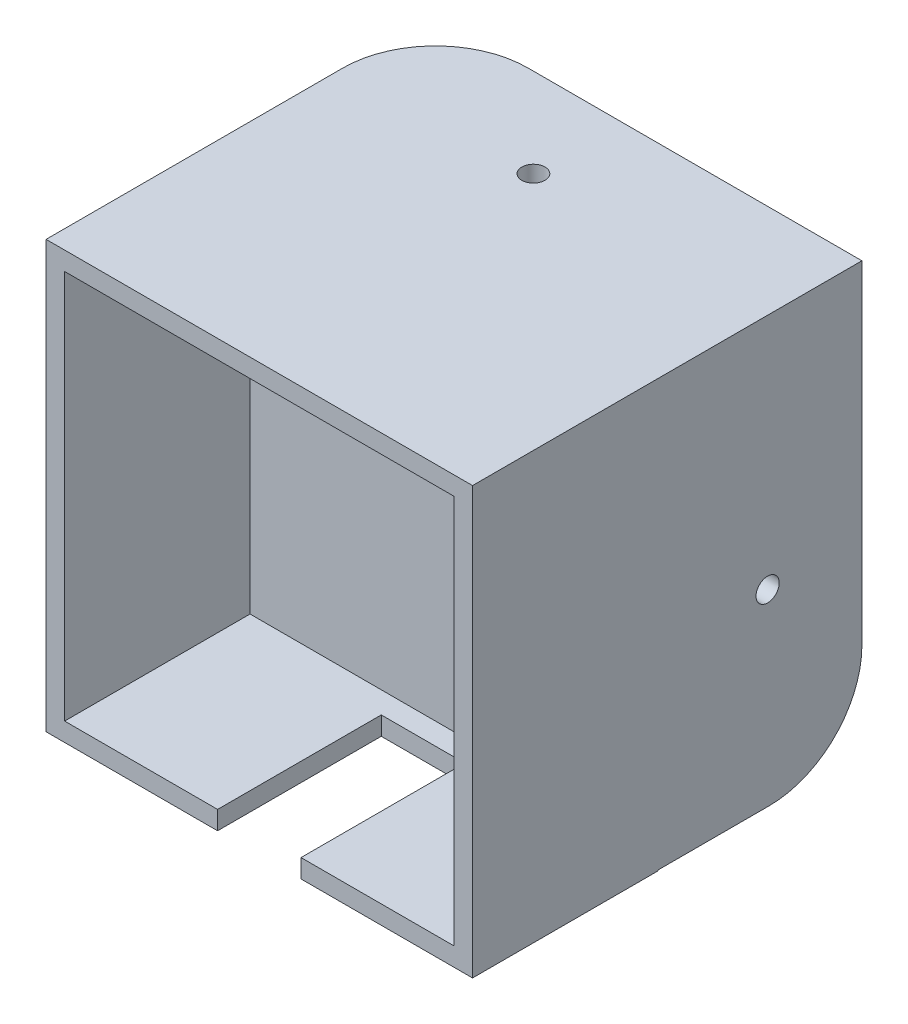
ISO-10303-21;
HEADER;
FILE_DESCRIPTION(('STEP AP214'),'2;1');
FILE_NAME('part.step','',(''),(''),'','','');
FILE_SCHEMA(('AUTOMOTIVE_DESIGN { 1 0 10303 214 1 1 1 1 }'));
ENDSEC;
DATA;
#1=APPLICATION_CONTEXT('core data for automotive mechanical design processes');
#2=APPLICATION_PROTOCOL_DEFINITION('international standard','automotive_design',2000,#1);
#3=PRODUCT_CONTEXT('',#1,'mechanical');
#4=PRODUCT('Part','Part','',(#3));
#5=PRODUCT_RELATED_PRODUCT_CATEGORY('part','',(#4));
#6=PRODUCT_DEFINITION_FORMATION('','',#4);
#7=PRODUCT_DEFINITION_CONTEXT('part definition',#1,'design');
#8=PRODUCT_DEFINITION('design','',#6,#7);
#9=PRODUCT_DEFINITION_SHAPE('','',#8);
#10=(LENGTH_UNIT() NAMED_UNIT(*) SI_UNIT(.MILLI.,.METRE.));
#11=(NAMED_UNIT(*) PLANE_ANGLE_UNIT() SI_UNIT($,.RADIAN.));
#12=(NAMED_UNIT(*) SI_UNIT($,.STERADIAN.) SOLID_ANGLE_UNIT());
#13=UNCERTAINTY_MEASURE_WITH_UNIT(LENGTH_MEASURE(1.E-05),#10,'distance_accuracy_value','');
#14=(GEOMETRIC_REPRESENTATION_CONTEXT(3) GLOBAL_UNCERTAINTY_ASSIGNED_CONTEXT((#13)) GLOBAL_UNIT_ASSIGNED_CONTEXT((#10,
#11,#12)) REPRESENTATION_CONTEXT('',''));
#15=CARTESIAN_POINT('',(0.,0.,0.));
#16=DIRECTION('',(0.,0.,1.));
#17=DIRECTION('',(1.,0.,0.));
#18=AXIS2_PLACEMENT_3D('',#15,#16,#17);
#19=CARTESIAN_POINT('',(0.,0.,-2.));
#20=DIRECTION('',(0.,0.,-1.));
#21=DIRECTION('',(-1.,0.,0.));
#22=AXIS2_PLACEMENT_3D('',#19,#20,#21);
#23=PLANE('',#22);
#24=DIRECTION('',(1.,0.,0.));
#25=VECTOR('',#24,1.);
#26=CARTESIAN_POINT('',(23.,18.,-2.));
#27=LINE('',#26,#25);
#28=CARTESIAN_POINT('',(-23.,18.,-2.));
#29=VERTEX_POINT('',#28);
#30=CARTESIAN_POINT('',(18.,18.,-2.));
#31=VERTEX_POINT('',#30);
#32=EDGE_CURVE('E175',#29,#31,#27,.T.);
#33=ORIENTED_EDGE('',*,*,#32,.T.);
#34=DIRECTION('',(0.,-1.,0.));
#35=VECTOR('',#34,1.);
#36=CARTESIAN_POINT('',(18.,-22.9159249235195,-2.));
#37=LINE('',#36,#35);
#38=CARTESIAN_POINT('',(18.,-22.9159249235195,-2.));
#39=VERTEX_POINT('',#38);
#40=EDGE_CURVE('E295',#31,#39,#37,.T.);
#41=ORIENTED_EDGE('',*,*,#40,.T.);
#42=DIRECTION('',(-1.,0.,0.));
#43=VECTOR('',#42,1.);
#44=CARTESIAN_POINT('',(23.,-22.9159249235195,-2.));
#45=LINE('',#44,#43);
#46=CARTESIAN_POINT('',(-23.,-22.9159249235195,-2.));
#47=VERTEX_POINT('',#46);
#48=EDGE_CURVE('E188',#39,#47,#45,.T.);
#49=ORIENTED_EDGE('',*,*,#48,.T.);
#50=DIRECTION('',(0.,1.,0.));
#51=VECTOR('',#50,1.);
#52=CARTESIAN_POINT('',(-23.,23.,-2.));
#53=LINE('',#52,#51);
#54=EDGE_CURVE('E170',#47,#29,#53,.T.);
#55=ORIENTED_EDGE('',*,*,#54,.T.);
#56=EDGE_LOOP('',(#33,#41,#49,#55));
#57=FACE_BOUND('',#56,.T.);
#58=ADVANCED_FACE('F33',(#57),#23,.T.);
#59=CARTESIAN_POINT('',(0.,0.,20.));
#60=DIRECTION('',(0.,0.,-1.));
#61=DIRECTION('',(-1.,0.,0.));
#62=AXIS2_PLACEMENT_3D('',#59,#60,#61);
#63=PLANE('',#62);
#64=DIRECTION('',(1.,0.,0.));
#65=VECTOR('',#64,1.);
#66=CARTESIAN_POINT('',(-23.,-23.,20.));
#67=LINE('',#66,#65);
#68=CARTESIAN_POINT('',(-23.,-23.,20.));
#69=VERTEX_POINT('',#68);
#70=CARTESIAN_POINT('',(-4.5,-23.,20.));
#71=VERTEX_POINT('',#70);
#72=EDGE_CURVE('E244',#69,#71,#67,.T.);
#73=ORIENTED_EDGE('',*,*,#72,.T.);
#74=DIRECTION('',(0.,1.,0.));
#75=VECTOR('',#74,1.);
#76=CARTESIAN_POINT('',(-4.5,0.,20.));
#77=LINE('',#76,#75);
#78=CARTESIAN_POINT('',(-4.5,-21.,20.));
#79=VERTEX_POINT('',#78);
#80=EDGE_CURVE('E199',#71,#79,#77,.T.);
#81=ORIENTED_EDGE('',*,*,#80,.T.);
#82=DIRECTION('',(1.,0.,0.));
#83=VECTOR('',#82,1.);
#84=CARTESIAN_POINT('',(-21.,-21.,20.));
#85=LINE('',#84,#83);
#86=CARTESIAN_POINT('',(-21.,-21.,20.));
#87=VERTEX_POINT('',#86);
#88=EDGE_CURVE('E207',#87,#79,#85,.T.);
#89=ORIENTED_EDGE('',*,*,#88,.F.);
#90=DIRECTION('',(0.,-1.,0.));
#91=VECTOR('',#90,1.);
#92=CARTESIAN_POINT('',(-21.,21.,20.));
#93=LINE('',#92,#91);
#94=CARTESIAN_POINT('',(-21.,21.,20.));
#95=VERTEX_POINT('',#94);
#96=EDGE_CURVE('E203',#95,#87,#93,.T.);
#97=ORIENTED_EDGE('',*,*,#96,.F.);
#98=DIRECTION('',(-1.,0.,0.));
#99=VECTOR('',#98,1.);
#100=CARTESIAN_POINT('',(-21.,21.,20.));
#101=LINE('',#100,#99);
#102=CARTESIAN_POINT('',(21.,21.,20.));
#103=VERTEX_POINT('',#102);
#104=EDGE_CURVE('E213',#103,#95,#101,.T.);
#105=ORIENTED_EDGE('',*,*,#104,.F.);
#106=DIRECTION('',(0.,1.,0.));
#107=VECTOR('',#106,1.);
#108=CARTESIAN_POINT('',(21.,21.,20.));
#109=LINE('',#108,#107);
#110=CARTESIAN_POINT('',(21.,-21.,20.));
#111=VERTEX_POINT('',#110);
#112=EDGE_CURVE('E210',#111,#103,#109,.T.);
#113=ORIENTED_EDGE('',*,*,#112,.F.);
#114=CARTESIAN_POINT('',(4.5,-21.,20.));
#115=VERTEX_POINT('',#114);
#116=EDGE_CURVE('E205',#115,#111,#85,.T.);
#117=ORIENTED_EDGE('',*,*,#116,.F.);
#118=DIRECTION('',(0.,-1.,0.));
#119=VECTOR('',#118,1.);
#120=CARTESIAN_POINT('',(4.5,0.,20.));
#121=LINE('',#120,#119);
#122=CARTESIAN_POINT('',(4.5,-23.,20.));
#123=VERTEX_POINT('',#122);
#124=EDGE_CURVE('E317',#115,#123,#121,.T.);
#125=ORIENTED_EDGE('',*,*,#124,.T.);
#126=CARTESIAN_POINT('',(23.,-23.,20.));
#127=VERTEX_POINT('',#126);
#128=EDGE_CURVE('E243',#123,#127,#67,.T.);
#129=ORIENTED_EDGE('',*,*,#128,.T.);
#130=DIRECTION('',(0.,1.,0.));
#131=VECTOR('',#130,1.);
#132=CARTESIAN_POINT('',(23.,23.,20.));
#133=LINE('',#132,#131);
#134=CARTESIAN_POINT('',(23.,23.,20.));
#135=VERTEX_POINT('',#134);
#136=EDGE_CURVE('E247',#127,#135,#133,.T.);
#137=ORIENTED_EDGE('',*,*,#136,.T.);
#138=DIRECTION('',(-1.,0.,0.));
#139=VECTOR('',#138,1.);
#140=CARTESIAN_POINT('',(-23.,23.,20.));
#141=LINE('',#140,#139);
#142=CARTESIAN_POINT('',(-23.,23.,20.));
#143=VERTEX_POINT('',#142);
#144=EDGE_CURVE('E237',#135,#143,#141,.T.);
#145=ORIENTED_EDGE('',*,*,#144,.T.);
#146=DIRECTION('',(0.,-1.,0.));
#147=VECTOR('',#146,1.);
#148=CARTESIAN_POINT('',(-23.,23.,20.));
#149=LINE('',#148,#147);
#150=EDGE_CURVE('E240',#143,#69,#149,.T.);
#151=ORIENTED_EDGE('',*,*,#150,.T.);
#152=EDGE_LOOP('',(#73,#81,#89,#97,#105,#113,#117,#125,#129,#137,#145,#151));
#153=FACE_BOUND('',#152,.T.);
#154=ADVANCED_FACE('F324',(#153),#63,.F.);
#155=CARTESIAN_POINT('',(0.,0.,0.));
#156=DIRECTION('',(0.,0.,-1.));
#157=DIRECTION('',(-1.,0.,0.));
#158=AXIS2_PLACEMENT_3D('',#155,#156,#157);
#159=PLANE('',#158);
#160=DIRECTION('',(-1.,0.,0.));
#161=VECTOR('',#160,1.);
#162=CARTESIAN_POINT('',(23.,-22.9159249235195,0.));
#163=LINE('',#162,#161);
#164=CARTESIAN_POINT('',(23.,-22.9159249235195,0.));
#165=VERTEX_POINT('',#164);
#166=CARTESIAN_POINT('',(-23.,-22.9159249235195,0.));
#167=VERTEX_POINT('',#166);
#168=EDGE_CURVE('E194',#165,#167,#163,.T.);
#169=ORIENTED_EDGE('',*,*,#168,.F.);
#170=DIRECTION('',(0.,1.,0.));
#171=VECTOR('',#170,1.);
#172=CARTESIAN_POINT('',(23.,23.,0.));
#173=LINE('',#172,#171);
#174=CARTESIAN_POINT('',(23.,-23.,0.));
#175=VERTEX_POINT('',#174);
#176=EDGE_CURVE('E241',#175,#165,#173,.T.);
#177=ORIENTED_EDGE('',*,*,#176,.F.);
#178=DIRECTION('',(1.,0.,0.));
#179=VECTOR('',#178,1.);
#180=CARTESIAN_POINT('',(-23.,-23.,0.));
#181=LINE('',#180,#179);
#182=CARTESIAN_POINT('',(-23.,-23.,0.));
#183=VERTEX_POINT('',#182);
#184=EDGE_CURVE('E251',#183,#175,#181,.T.);
#185=ORIENTED_EDGE('',*,*,#184,.F.);
#186=DIRECTION('',(0.,-1.,0.));
#187=VECTOR('',#186,1.);
#188=CARTESIAN_POINT('',(-23.,23.,0.));
#189=LINE('',#188,#187);
#190=EDGE_CURVE('E236',#167,#183,#189,.T.);
#191=ORIENTED_EDGE('',*,*,#190,.F.);
#192=EDGE_LOOP('',(#169,#177,#185,#191));
#193=FACE_BOUND('',#192,.T.);
#194=ADVANCED_FACE('F405',(#193),#159,.T.);
#195=CARTESIAN_POINT('',(-23.,23.,20.));
#196=DIRECTION('',(0.,-1.,0.));
#197=DIRECTION('',(0.,0.,-1.));
#198=AXIS2_PLACEMENT_3D('',#195,#196,#197);
#199=PLANE('',#198);
#200=CARTESIAN_POINT('',(-2.85275908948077,23.,-12.418447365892));
#201=DIRECTION('',(0.,-1.,0.));
#202=DIRECTION('',(0.,0.,-1.));
#203=AXIS2_PLACEMENT_3D('',#200,#201,#202);
#204=CIRCLE('',#203,1.25);
#205=CARTESIAN_POINT('',(-2.85275908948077,23.,-13.668447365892));
#206=VERTEX_POINT('',#205);
#207=EDGE_CURVE('E373',#206,#206,#204,.T.);
#208=ORIENTED_EDGE('',*,*,#207,.T.);
#209=EDGE_LOOP('',(#208));
#210=FACE_BOUND('',#209,.T.);
#211=DIRECTION('',(1.,0.,0.));
#212=VECTOR('',#211,1.);
#213=CARTESIAN_POINT('',(18.,23.,-22.));
#214=LINE('',#213,#212);
#215=CARTESIAN_POINT('',(-13.,23.,-22.));
#216=VERTEX_POINT('',#215);
#217=CARTESIAN_POINT('',(23.,23.,-22.));
#218=VERTEX_POINT('',#217);
#219=EDGE_CURVE('E294',#216,#218,#214,.T.);
#220=ORIENTED_EDGE('',*,*,#219,.F.);
#221=CARTESIAN_POINT('',(-13.,23.,-12.));
#222=DIRECTION('',(0.,-1.,0.));
#223=DIRECTION('',(0.,0.,-1.));
#224=AXIS2_PLACEMENT_3D('',#221,#222,#223);
#225=CIRCLE('',#224,10.);
#226=CARTESIAN_POINT('',(-23.,23.,-12.));
#227=VERTEX_POINT('',#226);
#228=EDGE_CURVE('E278',#216,#227,#225,.F.);
#229=ORIENTED_EDGE('',*,*,#228,.T.);
#230=DIRECTION('',(0.,0.,-1.));
#231=VECTOR('',#230,1.);
#232=CARTESIAN_POINT('',(-23.,23.,20.));
#233=LINE('',#232,#231);
#234=EDGE_CURVE('E263',#143,#227,#233,.T.);
#235=ORIENTED_EDGE('',*,*,#234,.F.);
#236=ORIENTED_EDGE('',*,*,#144,.F.);
#237=DIRECTION('',(0.,0.,-1.));
#238=VECTOR('',#237,1.);
#239=CARTESIAN_POINT('',(23.,23.,20.));
#240=LINE('',#239,#238);
#241=EDGE_CURVE('E249',#135,#218,#240,.T.);
#242=ORIENTED_EDGE('',*,*,#241,.T.);
#243=EDGE_LOOP('',(#220,#229,#235,#236,#242));
#244=FACE_BOUND('',#243,.T.);
#245=ADVANCED_FACE('F361',(#210,#244),#199,.F.);
#246=CARTESIAN_POINT('',(-23.,23.,20.));
#247=DIRECTION('',(1.,0.,0.));
#248=DIRECTION('',(0.,0.,-1.));
#249=AXIS2_PLACEMENT_3D('',#246,#247,#248);
#250=PLANE('',#249);
#251=ORIENTED_EDGE('',*,*,#234,.T.);
#252=DIRECTION('',(0.,1.,0.));
#253=VECTOR('',#252,1.);
#254=CARTESIAN_POINT('',(-23.,18.,-12.));
#255=LINE('',#254,#253);
#256=CARTESIAN_POINT('',(-23.,18.,-12.));
#257=VERTEX_POINT('',#256);
#258=EDGE_CURVE('E172',#227,#257,#255,.F.);
#259=ORIENTED_EDGE('',*,*,#258,.T.);
#260=DIRECTION('',(0.,0.,1.));
#261=VECTOR('',#260,1.);
#262=CARTESIAN_POINT('',(-23.,18.,-22.));
#263=LINE('',#262,#261);
#264=EDGE_CURVE('E164',#257,#29,#263,.T.);
#265=ORIENTED_EDGE('',*,*,#264,.T.);
#266=ORIENTED_EDGE('',*,*,#54,.F.);
#267=DIRECTION('',(0.,0.,1.));
#268=VECTOR('',#267,1.);
#269=CARTESIAN_POINT('',(-23.,-22.9159249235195,-2.));
#270=LINE('',#269,#268);
#271=EDGE_CURVE('E190',#47,#167,#270,.T.);
#272=ORIENTED_EDGE('',*,*,#271,.T.);
#273=ORIENTED_EDGE('',*,*,#190,.T.);
#274=DIRECTION('',(0.,0.,-1.));
#275=VECTOR('',#274,1.);
#276=CARTESIAN_POINT('',(-23.,-23.,20.));
#277=LINE('',#276,#275);
#278=EDGE_CURVE('E260',#69,#183,#277,.T.);
#279=ORIENTED_EDGE('',*,*,#278,.F.);
#280=ORIENTED_EDGE('',*,*,#150,.F.);
#281=EDGE_LOOP('',(#251,#259,#265,#266,#272,#273,#279,#280));
#282=FACE_BOUND('',#281,.T.);
#283=ADVANCED_FACE('F167',(#282),#250,.F.);
#284=CARTESIAN_POINT('',(-23.,-23.,20.));
#285=DIRECTION('',(0.,1.,0.));
#286=DIRECTION('',(-1.,0.,0.));
#287=AXIS2_PLACEMENT_3D('',#284,#285,#286);
#288=PLANE('',#287);
#289=DIRECTION('',(1.,0.,0.));
#290=VECTOR('',#289,1.);
#291=CARTESIAN_POINT('',(-4.5,-23.,2.34644712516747));
#292=LINE('',#291,#290);
#293=CARTESIAN_POINT('',(-4.5,-23.,2.34644712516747));
#294=VERTEX_POINT('',#293);
#295=CARTESIAN_POINT('',(4.5,-23.,2.34644712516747));
#296=VERTEX_POINT('',#295);
#297=EDGE_CURVE('E309',#294,#296,#292,.T.);
#298=ORIENTED_EDGE('',*,*,#297,.F.);
#299=DIRECTION('',(0.,0.,-1.));
#300=VECTOR('',#299,1.);
#301=CARTESIAN_POINT('',(-4.5,-23.,39.1871089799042));
#302=LINE('',#301,#300);
#303=EDGE_CURVE('E307',#71,#294,#302,.T.);
#304=ORIENTED_EDGE('',*,*,#303,.F.);
#305=ORIENTED_EDGE('',*,*,#72,.F.);
#306=ORIENTED_EDGE('',*,*,#278,.T.);
#307=ORIENTED_EDGE('',*,*,#184,.T.);
#308=DIRECTION('',(0.,0.,-1.));
#309=VECTOR('',#308,1.);
#310=CARTESIAN_POINT('',(23.,-23.,20.));
#311=LINE('',#310,#309);
#312=EDGE_CURVE('E257',#127,#175,#311,.T.);
#313=ORIENTED_EDGE('',*,*,#312,.F.);
#314=ORIENTED_EDGE('',*,*,#128,.F.);
#315=DIRECTION('',(0.,0.,1.));
#316=VECTOR('',#315,1.);
#317=CARTESIAN_POINT('',(4.5,-23.,39.1871089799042));
#318=LINE('',#317,#316);
#319=EDGE_CURVE('E312',#296,#123,#318,.T.);
#320=ORIENTED_EDGE('',*,*,#319,.F.);
#321=EDGE_LOOP('',(#298,#304,#305,#306,#307,#313,#314,#320));
#322=FACE_BOUND('',#321,.T.);
#323=ADVANCED_FACE('F355',(#322),#288,.F.);
#324=CARTESIAN_POINT('',(23.,23.,20.));
#325=DIRECTION('',(-1.,0.,0.));
#326=DIRECTION('',(0.,-1.,0.));
#327=AXIS2_PLACEMENT_3D('',#324,#325,#326);
#328=PLANE('',#327);
#329=CARTESIAN_POINT('',(23.,-2.62507308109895,-11.828426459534));
#330=DIRECTION('',(-1.,0.,0.));
#331=DIRECTION('',(0.,0.,1.));
#332=AXIS2_PLACEMENT_3D('',#329,#330,#331);
#333=CIRCLE('',#332,1.25);
#334=CARTESIAN_POINT('',(23.,-2.62507308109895,-10.578426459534));
#335=VERTEX_POINT('',#334);
#336=EDGE_CURVE('E366',#335,#335,#333,.T.);
#337=ORIENTED_EDGE('',*,*,#336,.T.);
#338=EDGE_LOOP('',(#337));
#339=FACE_BOUND('',#338,.T.);
#340=DIRECTION('',(0.,0.,1.));
#341=VECTOR('',#340,1.);
#342=CARTESIAN_POINT('',(23.,-22.9159249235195,-2.));
#343=LINE('',#342,#341);
#344=CARTESIAN_POINT('',(23.,-22.9159249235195,-12.));
#345=VERTEX_POINT('',#344);
#346=EDGE_CURVE('E192',#345,#165,#343,.T.);
#347=ORIENTED_EDGE('',*,*,#346,.F.);
#348=CARTESIAN_POINT('',(23.,-12.9159249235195,-12.));
#349=DIRECTION('',(-1.,0.,0.));
#350=DIRECTION('',(0.,-1.,0.));
#351=AXIS2_PLACEMENT_3D('',#348,#349,#350);
#352=CIRCLE('',#351,10.);
#353=CARTESIAN_POINT('',(23.,-12.9159249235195,-22.));
#354=VERTEX_POINT('',#353);
#355=EDGE_CURVE('E41',#345,#354,#352,.F.);
#356=ORIENTED_EDGE('',*,*,#355,.T.);
#357=DIRECTION('',(0.,1.,0.));
#358=VECTOR('',#357,1.);
#359=CARTESIAN_POINT('',(23.,-22.9159249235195,-22.));
#360=LINE('',#359,#358);
#361=EDGE_CURVE('E185',#354,#218,#360,.T.);
#362=ORIENTED_EDGE('',*,*,#361,.T.);
#363=ORIENTED_EDGE('',*,*,#241,.F.);
#364=ORIENTED_EDGE('',*,*,#136,.F.);
#365=ORIENTED_EDGE('',*,*,#312,.T.);
#366=ORIENTED_EDGE('',*,*,#176,.T.);
#367=EDGE_LOOP('',(#347,#356,#362,#363,#364,#365,#366));
#368=FACE_BOUND('',#367,.T.);
#369=ADVANCED_FACE('F287',(#339,#368),#328,.F.);
#370=CARTESIAN_POINT('',(-21.,21.,20.));
#371=DIRECTION('',(1.,0.,0.));
#372=DIRECTION('',(0.,1.,0.));
#373=AXIS2_PLACEMENT_3D('',#370,#371,#372);
#374=PLANE('',#373);
#375=DIRECTION('',(0.,-1.,0.));
#376=VECTOR('',#375,1.);
#377=CARTESIAN_POINT('',(-21.,21.,0.));
#378=LINE('',#377,#376);
#379=CARTESIAN_POINT('',(-21.,21.,0.));
#380=VERTEX_POINT('',#379);
#381=CARTESIAN_POINT('',(-21.,-21.,0.));
#382=VERTEX_POINT('',#381);
#383=EDGE_CURVE('E202',#380,#382,#378,.T.);
#384=ORIENTED_EDGE('',*,*,#383,.F.);
#385=DIRECTION('',(0.,0.,-1.));
#386=VECTOR('',#385,1.);
#387=CARTESIAN_POINT('',(-21.,21.,20.));
#388=LINE('',#387,#386);
#389=EDGE_CURVE('E215',#95,#380,#388,.T.);
#390=ORIENTED_EDGE('',*,*,#389,.F.);
#391=ORIENTED_EDGE('',*,*,#96,.T.);
#392=DIRECTION('',(0.,0.,-1.));
#393=VECTOR('',#392,1.);
#394=CARTESIAN_POINT('',(-21.,-21.,20.));
#395=LINE('',#394,#393);
#396=EDGE_CURVE('E233',#87,#382,#395,.T.);
#397=ORIENTED_EDGE('',*,*,#396,.T.);
#398=EDGE_LOOP('',(#384,#390,#391,#397));
#399=FACE_BOUND('',#398,.T.);
#400=ADVANCED_FACE('F335',(#399),#374,.T.);
#401=CARTESIAN_POINT('',(-21.,-21.,20.));
#402=DIRECTION('',(0.,1.,0.));
#403=DIRECTION('',(0.,0.,1.));
#404=AXIS2_PLACEMENT_3D('',#401,#402,#403);
#405=PLANE('',#404);
#406=DIRECTION('',(0.,0.,1.));
#407=VECTOR('',#406,1.);
#408=CARTESIAN_POINT('',(-4.5,-21.,20.));
#409=LINE('',#408,#407);
#410=CARTESIAN_POINT('',(-4.5,-21.,2.34644712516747));
#411=VERTEX_POINT('',#410);
#412=EDGE_CURVE('E270',#411,#79,#409,.T.);
#413=ORIENTED_EDGE('',*,*,#412,.F.);
#414=DIRECTION('',(-1.,0.,0.));
#415=VECTOR('',#414,1.);
#416=CARTESIAN_POINT('',(-21.,-21.,2.34644712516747));
#417=LINE('',#416,#415);
#418=CARTESIAN_POINT('',(4.5,-21.,2.34644712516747));
#419=VERTEX_POINT('',#418);
#420=EDGE_CURVE('E265',#419,#411,#417,.T.);
#421=ORIENTED_EDGE('',*,*,#420,.F.);
#422=DIRECTION('',(0.,0.,-1.));
#423=VECTOR('',#422,1.);
#424=CARTESIAN_POINT('',(4.5,-21.,20.));
#425=LINE('',#424,#423);
#426=EDGE_CURVE('E267',#115,#419,#425,.T.);
#427=ORIENTED_EDGE('',*,*,#426,.F.);
#428=ORIENTED_EDGE('',*,*,#116,.T.);
#429=DIRECTION('',(0.,0.,-1.));
#430=VECTOR('',#429,1.);
#431=CARTESIAN_POINT('',(21.,-21.,20.));
#432=LINE('',#431,#430);
#433=CARTESIAN_POINT('',(21.,-21.,0.));
#434=VERTEX_POINT('',#433);
#435=EDGE_CURVE('E231',#111,#434,#432,.T.);
#436=ORIENTED_EDGE('',*,*,#435,.T.);
#437=DIRECTION('',(1.,0.,0.));
#438=VECTOR('',#437,1.);
#439=CARTESIAN_POINT('',(-21.,-21.,0.));
#440=LINE('',#439,#438);
#441=EDGE_CURVE('E218',#382,#434,#440,.T.);
#442=ORIENTED_EDGE('',*,*,#441,.F.);
#443=ORIENTED_EDGE('',*,*,#396,.F.);
#444=ORIENTED_EDGE('',*,*,#88,.T.);
#445=EDGE_LOOP('',(#413,#421,#427,#428,#436,#442,#443,#444));
#446=FACE_BOUND('',#445,.T.);
#447=ADVANCED_FACE('F332',(#446),#405,.T.);
#448=CARTESIAN_POINT('',(21.,21.,20.));
#449=DIRECTION('',(-1.,0.,0.));
#450=DIRECTION('',(0.,0.,1.));
#451=AXIS2_PLACEMENT_3D('',#448,#449,#450);
#452=PLANE('',#451);
#453=DIRECTION('',(0.,1.,0.));
#454=VECTOR('',#453,1.);
#455=CARTESIAN_POINT('',(21.,21.,0.));
#456=LINE('',#455,#454);
#457=CARTESIAN_POINT('',(21.,21.,0.));
#458=VERTEX_POINT('',#457);
#459=EDGE_CURVE('E221',#434,#458,#456,.T.);
#460=ORIENTED_EDGE('',*,*,#459,.F.);
#461=ORIENTED_EDGE('',*,*,#435,.F.);
#462=ORIENTED_EDGE('',*,*,#112,.T.);
#463=DIRECTION('',(0.,0.,-1.));
#464=VECTOR('',#463,1.);
#465=CARTESIAN_POINT('',(21.,21.,20.));
#466=LINE('',#465,#464);
#467=EDGE_CURVE('E228',#103,#458,#466,.T.);
#468=ORIENTED_EDGE('',*,*,#467,.T.);
#469=EDGE_LOOP('',(#460,#461,#462,#468));
#470=FACE_BOUND('',#469,.T.);
#471=ADVANCED_FACE('F343',(#470),#452,.T.);
#472=CARTESIAN_POINT('',(-21.,21.,20.));
#473=DIRECTION('',(0.,-1.,0.));
#474=DIRECTION('',(0.,0.,-1.));
#475=AXIS2_PLACEMENT_3D('',#472,#473,#474);
#476=PLANE('',#475);
#477=DIRECTION('',(-1.,0.,0.));
#478=VECTOR('',#477,1.);
#479=CARTESIAN_POINT('',(-21.,21.,0.));
#480=LINE('',#479,#478);
#481=EDGE_CURVE('E206',#458,#380,#480,.T.);
#482=ORIENTED_EDGE('',*,*,#481,.F.);
#483=ORIENTED_EDGE('',*,*,#467,.F.);
#484=ORIENTED_EDGE('',*,*,#104,.T.);
#485=ORIENTED_EDGE('',*,*,#389,.T.);
#486=EDGE_LOOP('',(#482,#483,#484,#485));
#487=FACE_BOUND('',#486,.T.);
#488=ADVANCED_FACE('F341',(#487),#476,.T.);
#489=CARTESIAN_POINT('',(23.,-22.9159249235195,-2.));
#490=DIRECTION('',(0.,1.,0.));
#491=DIRECTION('',(0.,0.,1.));
#492=AXIS2_PLACEMENT_3D('',#489,#490,#491);
#493=PLANE('',#492);
#494=DIRECTION('',(0.,0.,-1.));
#495=VECTOR('',#494,1.);
#496=CARTESIAN_POINT('',(18.,-22.9159249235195,-2.));
#497=LINE('',#496,#495);
#498=CARTESIAN_POINT('',(18.,-22.9159249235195,-12.));
#499=VERTEX_POINT('',#498);
#500=EDGE_CURVE('E300',#39,#499,#497,.T.);
#501=ORIENTED_EDGE('',*,*,#500,.T.);
#502=DIRECTION('',(1.,0.,0.));
#503=VECTOR('',#502,1.);
#504=CARTESIAN_POINT('',(23.,-22.9159249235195,-12.));
#505=LINE('',#504,#503);
#506=EDGE_CURVE('E283',#499,#345,#505,.T.);
#507=ORIENTED_EDGE('',*,*,#506,.T.);
#508=ORIENTED_EDGE('',*,*,#346,.T.);
#509=ORIENTED_EDGE('',*,*,#168,.T.);
#510=ORIENTED_EDGE('',*,*,#271,.F.);
#511=ORIENTED_EDGE('',*,*,#48,.F.);
#512=EDGE_LOOP('',(#501,#507,#508,#509,#510,#511));
#513=FACE_BOUND('',#512,.T.);
#514=ADVANCED_FACE('F298',(#513),#493,.F.);
#515=CARTESIAN_POINT('',(0.,0.,0.));
#516=DIRECTION('',(0.,0.,-1.));
#517=DIRECTION('',(-1.,0.,0.));
#518=AXIS2_PLACEMENT_3D('',#515,#516,#517);
#519=PLANE('',#518);
#520=ORIENTED_EDGE('',*,*,#459,.T.);
#521=ORIENTED_EDGE('',*,*,#481,.T.);
#522=ORIENTED_EDGE('',*,*,#383,.T.);
#523=ORIENTED_EDGE('',*,*,#441,.T.);
#524=EDGE_LOOP('',(#520,#521,#522,#523));
#525=FACE_BOUND('',#524,.T.);
#526=ADVANCED_FACE('F338',(#525),#519,.F.);
#527=CARTESIAN_POINT('',(-4.5,-3.,39.1871089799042));
#528=DIRECTION('',(-1.,0.,0.));
#529=DIRECTION('',(0.,-1.,0.));
#530=AXIS2_PLACEMENT_3D('',#527,#528,#529);
#531=PLANE('',#530);
#532=ORIENTED_EDGE('',*,*,#303,.T.);
#533=DIRECTION('',(0.,-1.,0.));
#534=VECTOR('',#533,1.);
#535=CARTESIAN_POINT('',(-4.5,-3.,2.34644712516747));
#536=LINE('',#535,#534);
#537=EDGE_CURVE('E314',#411,#294,#536,.T.);
#538=ORIENTED_EDGE('',*,*,#537,.F.);
#539=ORIENTED_EDGE('',*,*,#412,.T.);
#540=ORIENTED_EDGE('',*,*,#80,.F.);
#541=EDGE_LOOP('',(#532,#538,#539,#540));
#542=FACE_BOUND('',#541,.T.);
#543=ADVANCED_FACE('F409',(#542),#531,.F.);
#544=CARTESIAN_POINT('',(4.5,-3.,39.1871089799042));
#545=DIRECTION('',(1.,0.,0.));
#546=DIRECTION('',(0.,1.,0.));
#547=AXIS2_PLACEMENT_3D('',#544,#545,#546);
#548=PLANE('',#547);
#549=ORIENTED_EDGE('',*,*,#426,.T.);
#550=DIRECTION('',(0.,-1.,0.));
#551=VECTOR('',#550,1.);
#552=CARTESIAN_POINT('',(4.5,-3.,2.34644712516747));
#553=LINE('',#552,#551);
#554=EDGE_CURVE('E315',#419,#296,#553,.T.);
#555=ORIENTED_EDGE('',*,*,#554,.T.);
#556=ORIENTED_EDGE('',*,*,#319,.T.);
#557=ORIENTED_EDGE('',*,*,#124,.F.);
#558=EDGE_LOOP('',(#549,#555,#556,#557));
#559=FACE_BOUND('',#558,.T.);
#560=ADVANCED_FACE('F351',(#559),#548,.F.);
#561=CARTESIAN_POINT('',(-4.5,-3.,2.34644712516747));
#562=DIRECTION('',(0.,0.,-1.));
#563=DIRECTION('',(-1.,0.,0.));
#564=AXIS2_PLACEMENT_3D('',#561,#562,#563);
#565=PLANE('',#564);
#566=ORIENTED_EDGE('',*,*,#420,.T.);
#567=ORIENTED_EDGE('',*,*,#537,.T.);
#568=ORIENTED_EDGE('',*,*,#297,.T.);
#569=ORIENTED_EDGE('',*,*,#554,.F.);
#570=EDGE_LOOP('',(#566,#567,#568,#569));
#571=FACE_BOUND('',#570,.T.);
#572=ADVANCED_FACE('F467',(#571),#565,.F.);
#573=CARTESIAN_POINT('',(18.,-22.9159249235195,-22.));
#574=DIRECTION('',(0.,0.,-1.));
#575=DIRECTION('',(-1.,0.,0.));
#576=AXIS2_PLACEMENT_3D('',#573,#574,#575);
#577=PLANE('',#576);
#578=DIRECTION('',(-1.,0.,0.));
#579=VECTOR('',#578,1.);
#580=CARTESIAN_POINT('',(23.,18.,-22.));
#581=LINE('',#580,#579);
#582=CARTESIAN_POINT('',(18.,18.,-22.));
#583=VERTEX_POINT('',#582);
#584=CARTESIAN_POINT('',(-13.,18.,-22.));
#585=VERTEX_POINT('',#584);
#586=EDGE_CURVE('E176',#583,#585,#581,.T.);
#587=ORIENTED_EDGE('',*,*,#586,.T.);
#588=DIRECTION('',(0.,1.,0.));
#589=VECTOR('',#588,1.);
#590=CARTESIAN_POINT('',(-13.,23.,-22.));
#591=LINE('',#590,#589);
#592=EDGE_CURVE('E275',#585,#216,#591,.T.);
#593=ORIENTED_EDGE('',*,*,#592,.T.);
#594=ORIENTED_EDGE('',*,*,#219,.T.);
#595=ORIENTED_EDGE('',*,*,#361,.F.);
#596=DIRECTION('',(1.,0.,0.));
#597=VECTOR('',#596,1.);
#598=CARTESIAN_POINT('',(18.,-12.9159249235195,-22.));
#599=LINE('',#598,#597);
#600=CARTESIAN_POINT('',(18.,-12.9159249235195,-22.));
#601=VERTEX_POINT('',#600);
#602=EDGE_CURVE('E273',#354,#601,#599,.F.);
#603=ORIENTED_EDGE('',*,*,#602,.T.);
#604=DIRECTION('',(0.,1.,0.));
#605=VECTOR('',#604,1.);
#606=CARTESIAN_POINT('',(18.,-22.9159249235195,-22.));
#607=LINE('',#606,#605);
#608=EDGE_CURVE('E301',#601,#583,#607,.T.);
#609=ORIENTED_EDGE('',*,*,#608,.T.);
#610=EDGE_LOOP('',(#587,#593,#594,#595,#603,#609));
#611=FACE_BOUND('',#610,.T.);
#612=ADVANCED_FACE('F292',(#611),#577,.T.);
#613=CARTESIAN_POINT('',(18.,0.,0.));
#614=DIRECTION('',(-1.,0.,0.));
#615=DIRECTION('',(0.,0.,1.));
#616=AXIS2_PLACEMENT_3D('',#613,#614,#615);
#617=PLANE('',#616);
#618=CARTESIAN_POINT('',(18.,-2.62507308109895,-11.828426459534));
#619=DIRECTION('',(-1.,0.,0.));
#620=DIRECTION('',(0.,0.,1.));
#621=AXIS2_PLACEMENT_3D('',#618,#619,#620);
#622=CIRCLE('',#621,1.25);
#623=CARTESIAN_POINT('',(18.,-2.62507308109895,-10.578426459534));
#624=VERTEX_POINT('',#623);
#625=EDGE_CURVE('E369',#624,#624,#622,.T.);
#626=ORIENTED_EDGE('',*,*,#625,.F.);
#627=EDGE_LOOP('',(#626));
#628=FACE_BOUND('',#627,.T.);
#629=ORIENTED_EDGE('',*,*,#608,.F.);
#630=CARTESIAN_POINT('',(18.,-12.9159249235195,-12.));
#631=DIRECTION('',(-1.,0.,0.));
#632=DIRECTION('',(0.,0.,1.));
#633=AXIS2_PLACEMENT_3D('',#630,#631,#632);
#634=CIRCLE('',#633,10.);
#635=EDGE_CURVE('E11',#601,#499,#634,.T.);
#636=ORIENTED_EDGE('',*,*,#635,.T.);
#637=ORIENTED_EDGE('',*,*,#500,.F.);
#638=ORIENTED_EDGE('',*,*,#40,.F.);
#639=DIRECTION('',(0.,0.,1.));
#640=VECTOR('',#639,1.);
#641=CARTESIAN_POINT('',(18.,18.,0.));
#642=LINE('',#641,#640);
#643=EDGE_CURVE('E182',#583,#31,#642,.T.);
#644=ORIENTED_EDGE('',*,*,#643,.F.);
#645=EDGE_LOOP('',(#629,#636,#637,#638,#644));
#646=FACE_BOUND('',#645,.T.);
#647=ADVANCED_FACE('F390',(#628,#646),#617,.T.);
#648=CARTESIAN_POINT('',(0.,18.,0.));
#649=DIRECTION('',(0.,-1.,0.));
#650=DIRECTION('',(0.,0.,-1.));
#651=AXIS2_PLACEMENT_3D('',#648,#649,#650);
#652=PLANE('',#651);
#653=CARTESIAN_POINT('',(-2.85275908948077,18.,-12.418447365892));
#654=DIRECTION('',(0.,-1.,0.));
#655=DIRECTION('',(0.,0.,-1.));
#656=AXIS2_PLACEMENT_3D('',#653,#654,#655);
#657=CIRCLE('',#656,1.25);
#658=CARTESIAN_POINT('',(-2.85275908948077,18.,-13.668447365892));
#659=VERTEX_POINT('',#658);
#660=EDGE_CURVE('E375',#659,#659,#657,.T.);
#661=ORIENTED_EDGE('',*,*,#660,.F.);
#662=EDGE_LOOP('',(#661));
#663=FACE_BOUND('',#662,.T.);
#664=ORIENTED_EDGE('',*,*,#264,.F.);
#665=CARTESIAN_POINT('',(-13.,18.,-12.));
#666=DIRECTION('',(0.,-1.,0.));
#667=DIRECTION('',(0.,0.,-1.));
#668=AXIS2_PLACEMENT_3D('',#665,#666,#667);
#669=CIRCLE('',#668,10.);
#670=EDGE_CURVE('E281',#257,#585,#669,.T.);
#671=ORIENTED_EDGE('',*,*,#670,.T.);
#672=ORIENTED_EDGE('',*,*,#586,.F.);
#673=ORIENTED_EDGE('',*,*,#643,.T.);
#674=ORIENTED_EDGE('',*,*,#32,.F.);
#675=EDGE_LOOP('',(#664,#671,#672,#673,#674));
#676=FACE_BOUND('',#675,.T.);
#677=ADVANCED_FACE('F179',(#663,#676),#652,.T.);
#678=CARTESIAN_POINT('',(23.,-2.62507308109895,-11.828426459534));
#679=DIRECTION('',(-1.,0.,0.));
#680=DIRECTION('',(0.,0.,1.));
#681=AXIS2_PLACEMENT_3D('',#678,#679,#680);
#682=CYLINDRICAL_SURFACE('',#681,1.25);
#683=ORIENTED_EDGE('',*,*,#336,.F.);
#684=EDGE_LOOP('',(#683));
#685=FACE_BOUND('',#684,.T.);
#686=ORIENTED_EDGE('',*,*,#625,.T.);
#687=EDGE_LOOP('',(#686));
#688=FACE_BOUND('',#687,.T.);
#689=ADVANCED_FACE('F385',(#685,#688),#682,.F.);
#690=CARTESIAN_POINT('',(-2.85275908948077,23.,-12.418447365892));
#691=DIRECTION('',(0.,-1.,0.));
#692=DIRECTION('',(0.,0.,-1.));
#693=AXIS2_PLACEMENT_3D('',#690,#691,#692);
#694=CYLINDRICAL_SURFACE('',#693,1.25);
#695=ORIENTED_EDGE('',*,*,#207,.F.);
#696=EDGE_LOOP('',(#695));
#697=FACE_BOUND('',#696,.T.);
#698=ORIENTED_EDGE('',*,*,#660,.T.);
#699=EDGE_LOOP('',(#698));
#700=FACE_BOUND('',#699,.T.);
#701=ADVANCED_FACE('F382',(#697,#700),#694,.F.);
#702=CARTESIAN_POINT('',(-13.,-22.9159249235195,-12.));
#703=DIRECTION('',(0.,-1.,0.));
#704=DIRECTION('',(0.,0.,-1.));
#705=AXIS2_PLACEMENT_3D('',#702,#703,#704);
#706=CYLINDRICAL_SURFACE('',#705,10.);
#707=ORIENTED_EDGE('',*,*,#670,.F.);
#708=ORIENTED_EDGE('',*,*,#258,.F.);
#709=ORIENTED_EDGE('',*,*,#228,.F.);
#710=ORIENTED_EDGE('',*,*,#592,.F.);
#711=EDGE_LOOP('',(#707,#708,#709,#710));
#712=FACE_BOUND('',#711,.T.);
#713=ADVANCED_FACE('F364',(#712),#706,.T.);
#714=CARTESIAN_POINT('',(23.,-12.9159249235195,-12.));
#715=DIRECTION('',(-1.,0.,0.));
#716=DIRECTION('',(0.,0.,1.));
#717=AXIS2_PLACEMENT_3D('',#714,#715,#716);
#718=CYLINDRICAL_SURFACE('',#717,10.);
#719=ORIENTED_EDGE('',*,*,#635,.F.);
#720=ORIENTED_EDGE('',*,*,#602,.F.);
#721=ORIENTED_EDGE('',*,*,#355,.F.);
#722=ORIENTED_EDGE('',*,*,#506,.F.);
#723=EDGE_LOOP('',(#719,#720,#721,#722));
#724=FACE_BOUND('',#723,.T.);
#725=ADVANCED_FACE('F35',(#724),#718,.T.);
#726=CLOSED_SHELL('',(#58,#154,#194,#245,#283,#323,#369,#400,#447,#471,#488,#514,#526,#543,#560,
#572,#612,#647,#677,#689,#701,#713,#725));
#727=MANIFOLD_SOLID_BREP('B2',#726);
#728=ADVANCED_BREP_SHAPE_REPRESENTATION('',(#18,#727),#14);
#729=SHAPE_DEFINITION_REPRESENTATION(#9,#728);
ENDSEC;
END-ISO-10303-21;
